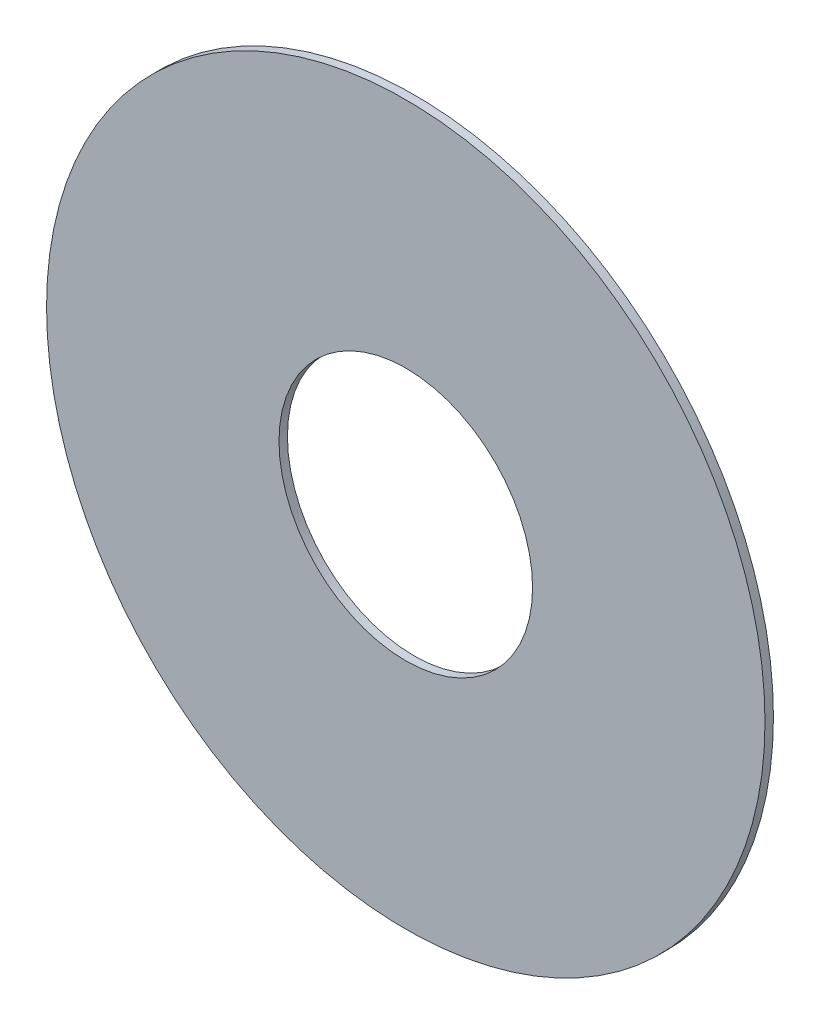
from build123d import *

# Parameters (mm, degrees)
ESQUISSE1_R          = 8.5
ESQUISSE1_R_2        = 3
BASE_EXTRUSION_DEPTH = 0.2


with BuildPart() as part:
    # Esquisse1 → Base-Extrusion (new body)
    with BuildSketch(Plane(origin=(0, 0, -0.2), x_dir=(-1, 0, 0), z_dir=(0, 0, -1))):
        with Locations(Location((0, 0, 0), (0, 0, 180))):
            Circle(ESQUISSE1_R)
        with Locations(Location((0, 0, 0), (0, 0, 180))):
            Circle(ESQUISSE1_R_2, mode=Mode.SUBTRACT)
    extrude(amount=-BASE_EXTRUSION_DEPTH)


solid = part.part
